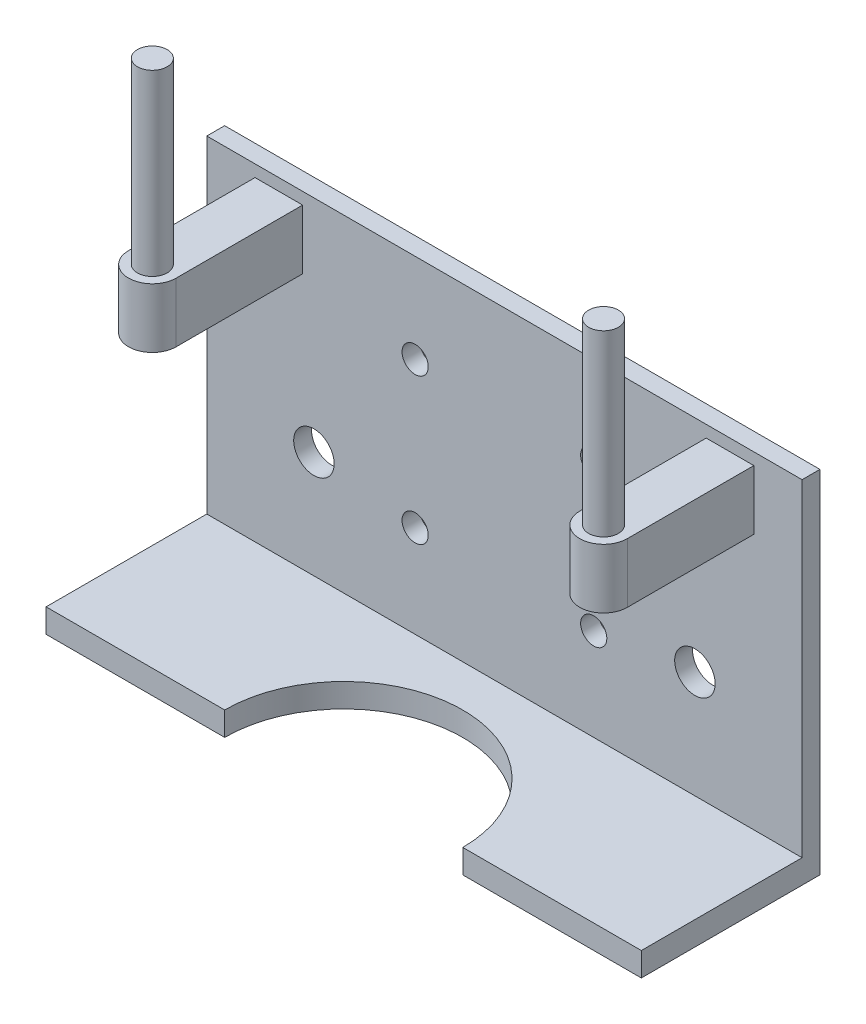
ISO-10303-21;
HEADER;
FILE_DESCRIPTION(('STEP AP214'),'2;1');
FILE_NAME('part.step','',(''),(''),'','','');
FILE_SCHEMA(('AUTOMOTIVE_DESIGN { 1 0 10303 214 1 1 1 1 }'));
ENDSEC;
DATA;
#1=APPLICATION_CONTEXT('core data for automotive mechanical design processes');
#2=APPLICATION_PROTOCOL_DEFINITION('international standard','automotive_design',2000,#1);
#3=PRODUCT_CONTEXT('',#1,'mechanical');
#4=PRODUCT('Part','Part','',(#3));
#5=PRODUCT_RELATED_PRODUCT_CATEGORY('part','',(#4));
#6=PRODUCT_DEFINITION_FORMATION('','',#4);
#7=PRODUCT_DEFINITION_CONTEXT('part definition',#1,'design');
#8=PRODUCT_DEFINITION('design','',#6,#7);
#9=PRODUCT_DEFINITION_SHAPE('','',#8);
#10=(LENGTH_UNIT() NAMED_UNIT(*) SI_UNIT(.MILLI.,.METRE.));
#11=(NAMED_UNIT(*) PLANE_ANGLE_UNIT() SI_UNIT($,.RADIAN.));
#12=(NAMED_UNIT(*) SI_UNIT($,.STERADIAN.) SOLID_ANGLE_UNIT());
#13=UNCERTAINTY_MEASURE_WITH_UNIT(LENGTH_MEASURE(1.E-05),#10,'distance_accuracy_value','');
#14=(GEOMETRIC_REPRESENTATION_CONTEXT(3) GLOBAL_UNCERTAINTY_ASSIGNED_CONTEXT((#13)) GLOBAL_UNIT_ASSIGNED_CONTEXT((#10,
#11,#12)) REPRESENTATION_CONTEXT('',''));
#15=CARTESIAN_POINT('',(0.,0.,0.));
#16=DIRECTION('',(0.,0.,1.));
#17=DIRECTION('',(1.,0.,0.));
#18=AXIS2_PLACEMENT_3D('',#15,#16,#17);
#19=CARTESIAN_POINT('',(-50.,-31.5,30.));
#20=DIRECTION('',(0.,0.,-1.));
#21=DIRECTION('',(-1.,0.,0.));
#22=AXIS2_PLACEMENT_3D('',#19,#20,#21);
#23=PLANE('',#22);
#24=DIRECTION('',(-1.,0.,0.));
#25=VECTOR('',#24,1.);
#26=CARTESIAN_POINT('',(-50.,-27.5,30.));
#27=LINE('',#26,#25);
#28=CARTESIAN_POINT('',(50.,-27.5,30.));
#29=VERTEX_POINT('',#28);
#30=CARTESIAN_POINT('',(20.,-27.5,30.));
#31=VERTEX_POINT('',#30);
#32=EDGE_CURVE('E165',#29,#31,#27,.T.);
#33=ORIENTED_EDGE('',*,*,#32,.T.);
#34=DIRECTION('',(0.,-1.,0.));
#35=VECTOR('',#34,1.);
#36=CARTESIAN_POINT('',(20.,-21.5,30.));
#37=LINE('',#36,#35);
#38=CARTESIAN_POINT('',(20.,-31.5,30.));
#39=VERTEX_POINT('',#38);
#40=EDGE_CURVE('E154',#31,#39,#37,.T.);
#41=ORIENTED_EDGE('',*,*,#40,.T.);
#42=DIRECTION('',(-1.,0.,0.));
#43=VECTOR('',#42,1.);
#44=CARTESIAN_POINT('',(-50.,-31.5,30.));
#45=LINE('',#44,#43);
#46=CARTESIAN_POINT('',(50.,-31.5,30.));
#47=VERTEX_POINT('',#46);
#48=EDGE_CURVE('E163',#47,#39,#45,.T.);
#49=ORIENTED_EDGE('',*,*,#48,.F.);
#50=DIRECTION('',(0.,1.,0.));
#51=VECTOR('',#50,1.);
#52=CARTESIAN_POINT('',(50.,-31.5,30.));
#53=LINE('',#52,#51);
#54=EDGE_CURVE('E178',#47,#29,#53,.T.);
#55=ORIENTED_EDGE('',*,*,#54,.T.);
#56=EDGE_LOOP('',(#33,#41,#49,#55));
#57=FACE_BOUND('',#56,.T.);
#58=ADVANCED_FACE('F40',(#57),#23,.F.);
#59=CARTESIAN_POINT('',(0.,0.,3.));
#60=DIRECTION('',(0.,0.,-1.));
#61=DIRECTION('',(-1.,0.,0.));
#62=AXIS2_PLACEMENT_3D('',#59,#60,#61);
#63=PLANE('',#62);
#64=CARTESIAN_POINT('',(15.,-12.,3.));
#65=DIRECTION('',(0.,0.,-1.));
#66=DIRECTION('',(-1.,0.,0.));
#67=AXIS2_PLACEMENT_3D('',#64,#65,#66);
#68=CIRCLE('',#67,2.2);
#69=CARTESIAN_POINT('',(12.8,-12.,3.));
#70=VERTEX_POINT('',#69);
#71=EDGE_CURVE('E229',#70,#70,#68,.T.);
#72=ORIENTED_EDGE('',*,*,#71,.T.);
#73=EDGE_LOOP('',(#72));
#74=FACE_BOUND('',#73,.T.);
#75=CARTESIAN_POINT('',(15.,12.5,3.));
#76=DIRECTION('',(0.,0.,-1.));
#77=DIRECTION('',(-1.,0.,0.));
#78=AXIS2_PLACEMENT_3D('',#75,#76,#77);
#79=CIRCLE('',#78,2.2);
#80=CARTESIAN_POINT('',(12.8,12.5,3.));
#81=VERTEX_POINT('',#80);
#82=EDGE_CURVE('E235',#81,#81,#79,.T.);
#83=ORIENTED_EDGE('',*,*,#82,.T.);
#84=EDGE_LOOP('',(#83));
#85=FACE_BOUND('',#84,.T.);
#86=CARTESIAN_POINT('',(-15.,-12.,3.));
#87=DIRECTION('',(0.,0.,1.));
#88=DIRECTION('',(1.,0.,0.));
#89=AXIS2_PLACEMENT_3D('',#86,#87,#88);
#90=CIRCLE('',#89,2.2);
#91=CARTESIAN_POINT('',(-12.8,-12.,3.));
#92=VERTEX_POINT('',#91);
#93=EDGE_CURVE('E225',#92,#92,#90,.T.);
#94=ORIENTED_EDGE('',*,*,#93,.F.);
#95=EDGE_LOOP('',(#94));
#96=FACE_BOUND('',#95,.T.);
#97=CARTESIAN_POINT('',(-15.,12.5,3.));
#98=DIRECTION('',(0.,0.,1.));
#99=DIRECTION('',(1.,0.,0.));
#100=AXIS2_PLACEMENT_3D('',#97,#98,#99);
#101=CIRCLE('',#100,2.2);
#102=CARTESIAN_POINT('',(-12.8,12.5,3.));
#103=VERTEX_POINT('',#102);
#104=EDGE_CURVE('E233',#103,#103,#101,.T.);
#105=ORIENTED_EDGE('',*,*,#104,.F.);
#106=EDGE_LOOP('',(#105));
#107=FACE_BOUND('',#106,.T.);
#108=CARTESIAN_POINT('',(-32.,-9.50000000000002,3.));
#109=DIRECTION('',(0.,0.,1.));
#110=DIRECTION('',(1.,0.,0.));
#111=AXIS2_PLACEMENT_3D('',#108,#109,#110);
#112=CIRCLE('',#111,3.39999999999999);
#113=CARTESIAN_POINT('',(-28.6,-9.50000000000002,3.));
#114=VERTEX_POINT('',#113);
#115=EDGE_CURVE('E166',#114,#114,#112,.T.);
#116=ORIENTED_EDGE('',*,*,#115,.F.);
#117=EDGE_LOOP('',(#116));
#118=FACE_BOUND('',#117,.T.);
#119=CARTESIAN_POINT('',(32.,-9.50000000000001,3.));
#120=DIRECTION('',(0.,0.,1.));
#121=DIRECTION('',(1.,0.,0.));
#122=AXIS2_PLACEMENT_3D('',#119,#120,#121);
#123=CIRCLE('',#122,3.39999999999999);
#124=CARTESIAN_POINT('',(35.4,-9.50000000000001,3.));
#125=VERTEX_POINT('',#124);
#126=EDGE_CURVE('E219',#125,#125,#123,.T.);
#127=ORIENTED_EDGE('',*,*,#126,.F.);
#128=EDGE_LOOP('',(#127));
#129=FACE_BOUND('',#128,.T.);
#130=DIRECTION('',(1.,0.,0.));
#131=VECTOR('',#130,1.);
#132=CARTESIAN_POINT('',(0.,15.5,3.));
#133=LINE('',#132,#131);
#134=CARTESIAN_POINT('',(33.9,15.5,3.));
#135=VERTEX_POINT('',#134);
#136=CARTESIAN_POINT('',(41.9,15.5,3.));
#137=VERTEX_POINT('',#136);
#138=EDGE_CURVE('E304',#135,#137,#133,.T.);
#139=ORIENTED_EDGE('',*,*,#138,.F.);
#140=DIRECTION('',(0.,1.,0.));
#141=VECTOR('',#140,1.);
#142=CARTESIAN_POINT('',(33.9,15.5,3.));
#143=LINE('',#142,#141);
#144=CARTESIAN_POINT('',(33.9,25.5,3.));
#145=VERTEX_POINT('',#144);
#146=EDGE_CURVE('E187',#135,#145,#143,.T.);
#147=ORIENTED_EDGE('',*,*,#146,.T.);
#148=DIRECTION('',(1.,0.,0.));
#149=VECTOR('',#148,1.);
#150=CARTESIAN_POINT('',(0.,25.5,3.));
#151=LINE('',#150,#149);
#152=CARTESIAN_POINT('',(41.9,25.5,3.));
#153=VERTEX_POINT('',#152);
#154=EDGE_CURVE('E299',#145,#153,#151,.T.);
#155=ORIENTED_EDGE('',*,*,#154,.T.);
#156=DIRECTION('',(0.,1.,0.));
#157=VECTOR('',#156,1.);
#158=CARTESIAN_POINT('',(41.9,15.5,3.));
#159=LINE('',#158,#157);
#160=EDGE_CURVE('E319',#137,#153,#159,.T.);
#161=ORIENTED_EDGE('',*,*,#160,.F.);
#162=EDGE_LOOP('',(#139,#147,#155,#161));
#163=FACE_BOUND('',#162,.T.);
#164=DIRECTION('',(0.,-1.,0.));
#165=VECTOR('',#164,1.);
#166=CARTESIAN_POINT('',(-50.,27.5,3.));
#167=LINE('',#166,#165);
#168=CARTESIAN_POINT('',(-50.,27.5,3.));
#169=VERTEX_POINT('',#168);
#170=CARTESIAN_POINT('',(-50.,-27.5,3.));
#171=VERTEX_POINT('',#170);
#172=EDGE_CURVE('E194',#169,#171,#167,.T.);
#173=ORIENTED_EDGE('',*,*,#172,.T.);
#174=DIRECTION('',(1.,0.,0.));
#175=VECTOR('',#174,1.);
#176=CARTESIAN_POINT('',(50.,-27.5,3.));
#177=LINE('',#176,#175);
#178=CARTESIAN_POINT('',(50.,-27.5,3.));
#179=VERTEX_POINT('',#178);
#180=EDGE_CURVE('E197',#171,#179,#177,.T.);
#181=ORIENTED_EDGE('',*,*,#180,.T.);
#182=DIRECTION('',(0.,1.,0.));
#183=VECTOR('',#182,1.);
#184=CARTESIAN_POINT('',(50.,27.5,3.));
#185=LINE('',#184,#183);
#186=CARTESIAN_POINT('',(50.,27.5,3.));
#187=VERTEX_POINT('',#186);
#188=EDGE_CURVE('E201',#179,#187,#185,.T.);
#189=ORIENTED_EDGE('',*,*,#188,.T.);
#190=DIRECTION('',(-1.,0.,0.));
#191=VECTOR('',#190,1.);
#192=CARTESIAN_POINT('',(50.,27.5,3.));
#193=LINE('',#192,#191);
#194=EDGE_CURVE('E203',#187,#169,#193,.T.);
#195=ORIENTED_EDGE('',*,*,#194,.T.);
#196=EDGE_LOOP('',(#173,#181,#189,#195));
#197=FACE_BOUND('',#196,.T.);
#198=DIRECTION('',(-1.,0.,0.));
#199=VECTOR('',#198,1.);
#200=CARTESIAN_POINT('',(0.,15.5,3.));
#201=LINE('',#200,#199);
#202=CARTESIAN_POINT('',(-33.9,15.5,3.));
#203=VERTEX_POINT('',#202);
#204=CARTESIAN_POINT('',(-41.9,15.5,3.));
#205=VERTEX_POINT('',#204);
#206=EDGE_CURVE('E261',#203,#205,#201,.T.);
#207=ORIENTED_EDGE('',*,*,#206,.T.);
#208=DIRECTION('',(0.,1.,0.));
#209=VECTOR('',#208,1.);
#210=CARTESIAN_POINT('',(-41.9,15.5,3.));
#211=LINE('',#210,#209);
#212=CARTESIAN_POINT('',(-41.9,25.5,3.));
#213=VERTEX_POINT('',#212);
#214=EDGE_CURVE('E285',#205,#213,#211,.T.);
#215=ORIENTED_EDGE('',*,*,#214,.T.);
#216=DIRECTION('',(-1.,0.,0.));
#217=VECTOR('',#216,1.);
#218=CARTESIAN_POINT('',(0.,25.5,3.));
#219=LINE('',#218,#217);
#220=CARTESIAN_POINT('',(-33.9,25.5,3.));
#221=VERTEX_POINT('',#220);
#222=EDGE_CURVE('E272',#221,#213,#219,.T.);
#223=ORIENTED_EDGE('',*,*,#222,.F.);
#224=DIRECTION('',(0.,1.,0.));
#225=VECTOR('',#224,1.);
#226=CARTESIAN_POINT('',(-33.9,15.5,3.));
#227=LINE('',#226,#225);
#228=EDGE_CURVE('E270',#203,#221,#227,.T.);
#229=ORIENTED_EDGE('',*,*,#228,.F.);
#230=EDGE_LOOP('',(#207,#215,#223,#229));
#231=FACE_BOUND('',#230,.T.);
#232=ADVANCED_FACE('F351',(#74,#85,#96,#107,#118,#129,#163,#197,#231),#63,.F.);
#233=CARTESIAN_POINT('',(-50.,27.5,3.));
#234=DIRECTION('',(1.,0.,0.));
#235=DIRECTION('',(0.,0.,-1.));
#236=AXIS2_PLACEMENT_3D('',#233,#234,#235);
#237=PLANE('',#236);
#238=DIRECTION('',(0.,-1.,0.));
#239=VECTOR('',#238,1.);
#240=CARTESIAN_POINT('',(-50.,27.5,0.));
#241=LINE('',#240,#239);
#242=CARTESIAN_POINT('',(-50.,27.5,0.));
#243=VERTEX_POINT('',#242);
#244=CARTESIAN_POINT('',(-50.,-31.5,0.));
#245=VERTEX_POINT('',#244);
#246=EDGE_CURVE('E193',#243,#245,#241,.T.);
#247=ORIENTED_EDGE('',*,*,#246,.T.);
#248=DIRECTION('',(0.,0.,-1.));
#249=VECTOR('',#248,1.);
#250=CARTESIAN_POINT('',(-50.,-31.5,0.));
#251=LINE('',#250,#249);
#252=CARTESIAN_POINT('',(-50.,-31.5,30.));
#253=VERTEX_POINT('',#252);
#254=EDGE_CURVE('E190',#253,#245,#251,.T.);
#255=ORIENTED_EDGE('',*,*,#254,.F.);
#256=DIRECTION('',(0.,1.,0.));
#257=VECTOR('',#256,1.);
#258=CARTESIAN_POINT('',(-50.,-31.5,30.));
#259=LINE('',#258,#257);
#260=CARTESIAN_POINT('',(-50.,-27.5,30.));
#261=VERTEX_POINT('',#260);
#262=EDGE_CURVE('E174',#253,#261,#259,.T.);
#263=ORIENTED_EDGE('',*,*,#262,.T.);
#264=DIRECTION('',(0.,0.,-1.));
#265=VECTOR('',#264,1.);
#266=CARTESIAN_POINT('',(-50.,-27.5,0.));
#267=LINE('',#266,#265);
#268=EDGE_CURVE('E183',#261,#171,#267,.T.);
#269=ORIENTED_EDGE('',*,*,#268,.T.);
#270=ORIENTED_EDGE('',*,*,#172,.F.);
#271=DIRECTION('',(0.,0.,-1.));
#272=VECTOR('',#271,1.);
#273=CARTESIAN_POINT('',(-50.,27.5,3.));
#274=LINE('',#273,#272);
#275=EDGE_CURVE('E205',#169,#243,#274,.T.);
#276=ORIENTED_EDGE('',*,*,#275,.T.);
#277=EDGE_LOOP('',(#247,#255,#263,#269,#270,#276));
#278=FACE_BOUND('',#277,.T.);
#279=ADVANCED_FACE('F42',(#278),#237,.F.);
#280=CARTESIAN_POINT('',(50.,27.5,3.));
#281=DIRECTION('',(-1.,0.,0.));
#282=DIRECTION('',(0.,-1.,0.));
#283=AXIS2_PLACEMENT_3D('',#280,#281,#282);
#284=PLANE('',#283);
#285=DIRECTION('',(0.,1.,0.));
#286=VECTOR('',#285,1.);
#287=CARTESIAN_POINT('',(50.,27.5,0.));
#288=LINE('',#287,#286);
#289=CARTESIAN_POINT('',(50.,-31.5,0.));
#290=VERTEX_POINT('',#289);
#291=CARTESIAN_POINT('',(50.,27.5,0.));
#292=VERTEX_POINT('',#291);
#293=EDGE_CURVE('E207',#290,#292,#288,.T.);
#294=ORIENTED_EDGE('',*,*,#293,.T.);
#295=DIRECTION('',(0.,0.,-1.));
#296=VECTOR('',#295,1.);
#297=CARTESIAN_POINT('',(50.,27.5,3.));
#298=LINE('',#297,#296);
#299=EDGE_CURVE('E212',#187,#292,#298,.T.);
#300=ORIENTED_EDGE('',*,*,#299,.F.);
#301=ORIENTED_EDGE('',*,*,#188,.F.);
#302=DIRECTION('',(0.,0.,1.));
#303=VECTOR('',#302,1.);
#304=CARTESIAN_POINT('',(50.,-27.5,0.));
#305=LINE('',#304,#303);
#306=EDGE_CURVE('E186',#179,#29,#305,.T.);
#307=ORIENTED_EDGE('',*,*,#306,.T.);
#308=ORIENTED_EDGE('',*,*,#54,.F.);
#309=DIRECTION('',(0.,0.,1.));
#310=VECTOR('',#309,1.);
#311=CARTESIAN_POINT('',(50.,-31.5,0.));
#312=LINE('',#311,#310);
#313=EDGE_CURVE('E172',#290,#47,#312,.T.);
#314=ORIENTED_EDGE('',*,*,#313,.F.);
#315=EDGE_LOOP('',(#294,#300,#301,#307,#308,#314));
#316=FACE_BOUND('',#315,.T.);
#317=ADVANCED_FACE('F332',(#316),#284,.F.);
#318=CARTESIAN_POINT('',(50.,27.5,3.));
#319=DIRECTION('',(0.,-1.,0.));
#320=DIRECTION('',(1.,0.,0.));
#321=AXIS2_PLACEMENT_3D('',#318,#319,#320);
#322=PLANE('',#321);
#323=DIRECTION('',(-1.,0.,0.));
#324=VECTOR('',#323,1.);
#325=CARTESIAN_POINT('',(50.,27.5,0.));
#326=LINE('',#325,#324);
#327=EDGE_CURVE('E198',#292,#243,#326,.T.);
#328=ORIENTED_EDGE('',*,*,#327,.T.);
#329=ORIENTED_EDGE('',*,*,#275,.F.);
#330=ORIENTED_EDGE('',*,*,#194,.F.);
#331=ORIENTED_EDGE('',*,*,#299,.T.);
#332=EDGE_LOOP('',(#328,#329,#330,#331));
#333=FACE_BOUND('',#332,.T.);
#334=ADVANCED_FACE('F348',(#333),#322,.F.);
#335=CARTESIAN_POINT('',(0.,0.,0.));
#336=DIRECTION('',(0.,0.,-1.));
#337=DIRECTION('',(-1.,0.,0.));
#338=AXIS2_PLACEMENT_3D('',#335,#336,#337);
#339=PLANE('',#338);
#340=CARTESIAN_POINT('',(15.,-12.,0.));
#341=DIRECTION('',(0.,0.,-1.));
#342=DIRECTION('',(-1.,0.,0.));
#343=AXIS2_PLACEMENT_3D('',#340,#341,#342);
#344=CIRCLE('',#343,2.2);
#345=CARTESIAN_POINT('',(12.8,-12.,0.));
#346=VERTEX_POINT('',#345);
#347=EDGE_CURVE('E44',#346,#346,#344,.F.);
#348=ORIENTED_EDGE('',*,*,#347,.T.);
#349=EDGE_LOOP('',(#348));
#350=FACE_BOUND('',#349,.T.);
#351=CARTESIAN_POINT('',(15.,12.5,0.));
#352=DIRECTION('',(0.,0.,-1.));
#353=DIRECTION('',(-1.,0.,0.));
#354=AXIS2_PLACEMENT_3D('',#351,#352,#353);
#355=CIRCLE('',#354,2.2);
#356=CARTESIAN_POINT('',(12.8,12.5,0.));
#357=VERTEX_POINT('',#356);
#358=EDGE_CURVE('E227',#357,#357,#355,.F.);
#359=ORIENTED_EDGE('',*,*,#358,.T.);
#360=EDGE_LOOP('',(#359));
#361=FACE_BOUND('',#360,.T.);
#362=CARTESIAN_POINT('',(-15.,-12.,0.));
#363=DIRECTION('',(0.,0.,-1.));
#364=DIRECTION('',(-1.,0.,0.));
#365=AXIS2_PLACEMENT_3D('',#362,#363,#364);
#366=CIRCLE('',#365,2.2);
#367=CARTESIAN_POINT('',(-17.2,-12.,0.));
#368=VERTEX_POINT('',#367);
#369=EDGE_CURVE('E224',#368,#368,#366,.T.);
#370=ORIENTED_EDGE('',*,*,#369,.F.);
#371=EDGE_LOOP('',(#370));
#372=FACE_BOUND('',#371,.T.);
#373=CARTESIAN_POINT('',(-15.,12.5,0.));
#374=DIRECTION('',(0.,0.,-1.));
#375=DIRECTION('',(-1.,0.,0.));
#376=AXIS2_PLACEMENT_3D('',#373,#374,#375);
#377=CIRCLE('',#376,2.2);
#378=CARTESIAN_POINT('',(-17.2,12.5,0.));
#379=VERTEX_POINT('',#378);
#380=EDGE_CURVE('E221',#379,#379,#377,.T.);
#381=ORIENTED_EDGE('',*,*,#380,.F.);
#382=EDGE_LOOP('',(#381));
#383=FACE_BOUND('',#382,.T.);
#384=CARTESIAN_POINT('',(-32.,-9.50000000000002,0.));
#385=DIRECTION('',(0.,0.,-1.));
#386=DIRECTION('',(-1.,0.,0.));
#387=AXIS2_PLACEMENT_3D('',#384,#385,#386);
#388=CIRCLE('',#387,3.39999999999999);
#389=CARTESIAN_POINT('',(-35.4,-9.50000000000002,0.));
#390=VERTEX_POINT('',#389);
#391=EDGE_CURVE('E217',#390,#390,#388,.T.);
#392=ORIENTED_EDGE('',*,*,#391,.F.);
#393=EDGE_LOOP('',(#392));
#394=FACE_BOUND('',#393,.T.);
#395=CARTESIAN_POINT('',(32.,-9.50000000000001,0.));
#396=DIRECTION('',(0.,0.,-1.));
#397=DIRECTION('',(-1.,0.,0.));
#398=AXIS2_PLACEMENT_3D('',#395,#396,#397);
#399=CIRCLE('',#398,3.39999999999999);
#400=CARTESIAN_POINT('',(28.6,-9.50000000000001,0.));
#401=VERTEX_POINT('',#400);
#402=EDGE_CURVE('E252',#401,#401,#399,.T.);
#403=ORIENTED_EDGE('',*,*,#402,.F.);
#404=EDGE_LOOP('',(#403));
#405=FACE_BOUND('',#404,.T.);
#406=ORIENTED_EDGE('',*,*,#246,.F.);
#407=ORIENTED_EDGE('',*,*,#327,.F.);
#408=ORIENTED_EDGE('',*,*,#293,.F.);
#409=DIRECTION('',(1.,0.,0.));
#410=VECTOR('',#409,1.);
#411=CARTESIAN_POINT('',(-50.,-31.5,0.));
#412=LINE('',#411,#410);
#413=EDGE_CURVE('E326',#245,#290,#412,.T.);
#414=ORIENTED_EDGE('',*,*,#413,.F.);
#415=EDGE_LOOP('',(#406,#407,#408,#414));
#416=FACE_BOUND('',#415,.T.);
#417=ADVANCED_FACE('F346',(#350,#361,#372,#383,#394,#405,#416),#339,.T.);
#418=CARTESIAN_POINT('',(0.,-27.5,0.));
#419=DIRECTION('',(0.,1.,0.));
#420=DIRECTION('',(-1.,0.,0.));
#421=AXIS2_PLACEMENT_3D('',#418,#419,#420);
#422=PLANE('',#421);
#423=CARTESIAN_POINT('',(0.,-27.5,30.));
#424=DIRECTION('',(0.,1.,0.));
#425=DIRECTION('',(-1.,0.,0.));
#426=AXIS2_PLACEMENT_3D('',#423,#424,#425);
#427=CIRCLE('',#426,20.);
#428=CARTESIAN_POINT('',(-20.,-27.5,30.));
#429=VERTEX_POINT('',#428);
#430=EDGE_CURVE('E167',#31,#429,#427,.T.);
#431=ORIENTED_EDGE('',*,*,#430,.F.);
#432=ORIENTED_EDGE('',*,*,#32,.F.);
#433=ORIENTED_EDGE('',*,*,#306,.F.);
#434=ORIENTED_EDGE('',*,*,#180,.F.);
#435=ORIENTED_EDGE('',*,*,#268,.F.);
#436=EDGE_CURVE('E189',#429,#261,#27,.T.);
#437=ORIENTED_EDGE('',*,*,#436,.F.);
#438=EDGE_LOOP('',(#431,#432,#433,#434,#435,#437));
#439=FACE_BOUND('',#438,.T.);
#440=ADVANCED_FACE('F336',(#439),#422,.T.);
#441=CARTESIAN_POINT('',(-20.,-31.5,30.));
#442=VERTEX_POINT('',#441);
#443=EDGE_CURVE('E175',#442,#253,#45,.T.);
#444=ORIENTED_EDGE('',*,*,#443,.F.);
#445=DIRECTION('',(0.,-1.,0.));
#446=VECTOR('',#445,1.);
#447=CARTESIAN_POINT('',(-20.,-21.5,30.));
#448=LINE('',#447,#446);
#449=EDGE_CURVE('E57',#442,#429,#448,.F.);
#450=ORIENTED_EDGE('',*,*,#449,.T.);
#451=ORIENTED_EDGE('',*,*,#436,.T.);
#452=ORIENTED_EDGE('',*,*,#262,.F.);
#453=EDGE_LOOP('',(#444,#450,#451,#452));
#454=FACE_BOUND('',#453,.T.);
#455=ADVANCED_FACE('F340',(#454),#23,.F.);
#456=CARTESIAN_POINT('',(0.,-31.5,0.));
#457=DIRECTION('',(0.,1.,0.));
#458=DIRECTION('',(-1.,0.,0.));
#459=AXIS2_PLACEMENT_3D('',#456,#457,#458);
#460=PLANE('',#459);
#461=ORIENTED_EDGE('',*,*,#48,.T.);
#462=CARTESIAN_POINT('',(0.,-31.5,30.));
#463=DIRECTION('',(0.,1.,0.));
#464=DIRECTION('',(-1.,0.,0.));
#465=AXIS2_PLACEMENT_3D('',#462,#463,#464);
#466=CIRCLE('',#465,20.);
#467=EDGE_CURVE('E11',#39,#442,#466,.T.);
#468=ORIENTED_EDGE('',*,*,#467,.T.);
#469=ORIENTED_EDGE('',*,*,#443,.T.);
#470=ORIENTED_EDGE('',*,*,#254,.T.);
#471=ORIENTED_EDGE('',*,*,#413,.T.);
#472=ORIENTED_EDGE('',*,*,#313,.T.);
#473=EDGE_LOOP('',(#461,#468,#469,#470,#471,#472));
#474=FACE_BOUND('',#473,.T.);
#475=ADVANCED_FACE('F169',(#474),#460,.F.);
#476=CARTESIAN_POINT('',(33.9,15.5,0.));
#477=DIRECTION('',(-1.,0.,0.));
#478=DIRECTION('',(0.,-1.,0.));
#479=AXIS2_PLACEMENT_3D('',#476,#477,#478);
#480=PLANE('',#479);
#481=DIRECTION('',(0.,0.,1.));
#482=VECTOR('',#481,1.);
#483=CARTESIAN_POINT('',(33.9,25.5,0.));
#484=LINE('',#483,#482);
#485=CARTESIAN_POINT('',(33.9,25.5,24.25));
#486=VERTEX_POINT('',#485);
#487=EDGE_CURVE('E292',#145,#486,#484,.T.);
#488=ORIENTED_EDGE('',*,*,#487,.F.);
#489=ORIENTED_EDGE('',*,*,#146,.F.);
#490=DIRECTION('',(0.,0.,1.));
#491=VECTOR('',#490,1.);
#492=CARTESIAN_POINT('',(33.9,15.5,0.));
#493=LINE('',#492,#491);
#494=CARTESIAN_POINT('',(33.9,15.5,24.25));
#495=VERTEX_POINT('',#494);
#496=EDGE_CURVE('E295',#135,#495,#493,.T.);
#497=ORIENTED_EDGE('',*,*,#496,.T.);
#498=DIRECTION('',(0.,1.,0.));
#499=VECTOR('',#498,1.);
#500=CARTESIAN_POINT('',(33.9,15.5,24.25));
#501=LINE('',#500,#499);
#502=EDGE_CURVE('E306',#495,#486,#501,.T.);
#503=ORIENTED_EDGE('',*,*,#502,.T.);
#504=EDGE_LOOP('',(#488,#489,#497,#503));
#505=FACE_BOUND('',#504,.T.);
#506=ADVANCED_FACE('F390',(#505),#480,.T.);
#507=CARTESIAN_POINT('',(41.9,15.5,0.));
#508=DIRECTION('',(-1.,0.,0.));
#509=DIRECTION('',(0.,0.,1.));
#510=AXIS2_PLACEMENT_3D('',#507,#508,#509);
#511=PLANE('',#510);
#512=DIRECTION('',(0.,0.,1.));
#513=VECTOR('',#512,1.);
#514=CARTESIAN_POINT('',(41.9,25.5,0.));
#515=LINE('',#514,#513);
#516=CARTESIAN_POINT('',(41.9,25.5,24.25));
#517=VERTEX_POINT('',#516);
#518=EDGE_CURVE('E312',#153,#517,#515,.T.);
#519=ORIENTED_EDGE('',*,*,#518,.T.);
#520=DIRECTION('',(0.,1.,0.));
#521=VECTOR('',#520,1.);
#522=CARTESIAN_POINT('',(41.9,15.5,24.25));
#523=LINE('',#522,#521);
#524=CARTESIAN_POINT('',(41.9,15.5,24.25));
#525=VERTEX_POINT('',#524);
#526=EDGE_CURVE('E322',#525,#517,#523,.T.);
#527=ORIENTED_EDGE('',*,*,#526,.F.);
#528=DIRECTION('',(0.,0.,1.));
#529=VECTOR('',#528,1.);
#530=CARTESIAN_POINT('',(41.9,15.5,0.));
#531=LINE('',#530,#529);
#532=EDGE_CURVE('E302',#137,#525,#531,.T.);
#533=ORIENTED_EDGE('',*,*,#532,.F.);
#534=ORIENTED_EDGE('',*,*,#160,.T.);
#535=EDGE_LOOP('',(#519,#527,#533,#534));
#536=FACE_BOUND('',#535,.T.);
#537=ADVANCED_FACE('F400',(#536),#511,.F.);
#538=CARTESIAN_POINT('',(37.9,15.5,24.25));
#539=DIRECTION('',(0.,1.,0.));
#540=DIRECTION('',(-1.,0.,0.));
#541=AXIS2_PLACEMENT_3D('',#538,#539,#540);
#542=CYLINDRICAL_SURFACE('',#541,3.99999999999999);
#543=CARTESIAN_POINT('',(37.9,25.5,24.25));
#544=DIRECTION('',(0.,1.,0.));
#545=DIRECTION('',(-1.,0.,0.));
#546=AXIS2_PLACEMENT_3D('',#543,#544,#545);
#547=CIRCLE('',#546,3.99999999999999);
#548=EDGE_CURVE('E309',#486,#517,#547,.T.);
#549=ORIENTED_EDGE('',*,*,#548,.F.);
#550=ORIENTED_EDGE('',*,*,#502,.F.);
#551=CARTESIAN_POINT('',(37.9,15.5,24.25));
#552=DIRECTION('',(0.,1.,0.));
#553=DIRECTION('',(-1.,0.,0.));
#554=AXIS2_PLACEMENT_3D('',#551,#552,#553);
#555=CIRCLE('',#554,3.99999999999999);
#556=EDGE_CURVE('E298',#495,#525,#555,.T.);
#557=ORIENTED_EDGE('',*,*,#556,.T.);
#558=ORIENTED_EDGE('',*,*,#526,.T.);
#559=EDGE_LOOP('',(#549,#550,#557,#558));
#560=FACE_BOUND('',#559,.T.);
#561=ADVANCED_FACE('F402',(#560),#542,.T.);
#562=CARTESIAN_POINT('',(0.,15.5,0.));
#563=DIRECTION('',(0.,1.,0.));
#564=DIRECTION('',(-1.,0.,0.));
#565=AXIS2_PLACEMENT_3D('',#562,#563,#564);
#566=PLANE('',#565);
#567=ORIENTED_EDGE('',*,*,#496,.F.);
#568=ORIENTED_EDGE('',*,*,#138,.T.);
#569=ORIENTED_EDGE('',*,*,#532,.T.);
#570=ORIENTED_EDGE('',*,*,#556,.F.);
#571=EDGE_LOOP('',(#567,#568,#569,#570));
#572=FACE_BOUND('',#571,.T.);
#573=ADVANCED_FACE('F405',(#572),#566,.F.);
#574=CARTESIAN_POINT('',(0.,25.5,0.));
#575=DIRECTION('',(0.,1.,0.));
#576=DIRECTION('',(-1.,0.,0.));
#577=AXIS2_PLACEMENT_3D('',#574,#575,#576);
#578=PLANE('',#577);
#579=CARTESIAN_POINT('',(37.9,25.5,24.25));
#580=DIRECTION('',(0.,1.,0.));
#581=DIRECTION('',(-1.,0.,0.));
#582=AXIS2_PLACEMENT_3D('',#579,#580,#581);
#583=CIRCLE('',#582,2.5);
#584=CARTESIAN_POINT('',(35.4,25.5,24.25));
#585=VERTEX_POINT('',#584);
#586=EDGE_CURVE('E282',#585,#585,#583,.T.);
#587=ORIENTED_EDGE('',*,*,#586,.F.);
#588=EDGE_LOOP('',(#587));
#589=FACE_BOUND('',#588,.T.);
#590=ORIENTED_EDGE('',*,*,#487,.T.);
#591=ORIENTED_EDGE('',*,*,#548,.T.);
#592=ORIENTED_EDGE('',*,*,#518,.F.);
#593=ORIENTED_EDGE('',*,*,#154,.F.);
#594=EDGE_LOOP('',(#590,#591,#592,#593));
#595=FACE_BOUND('',#594,.T.);
#596=ADVANCED_FACE('F410',(#589,#595),#578,.T.);
#597=CARTESIAN_POINT('',(37.9,55.5,24.25));
#598=DIRECTION('',(0.,-1.,0.));
#599=DIRECTION('',(1.,0.,0.));
#600=AXIS2_PLACEMENT_3D('',#597,#598,#599);
#601=CYLINDRICAL_SURFACE('',#600,2.5);
#602=CARTESIAN_POINT('',(37.9,55.5,24.25));
#603=DIRECTION('',(0.,1.,0.));
#604=DIRECTION('',(-1.,0.,0.));
#605=AXIS2_PLACEMENT_3D('',#602,#603,#604);
#606=CIRCLE('',#605,2.5);
#607=CARTESIAN_POINT('',(35.4,55.5,24.25));
#608=VERTEX_POINT('',#607);
#609=EDGE_CURVE('E289',#608,#608,#606,.T.);
#610=ORIENTED_EDGE('',*,*,#609,.F.);
#611=EDGE_LOOP('',(#610));
#612=FACE_BOUND('',#611,.T.);
#613=ORIENTED_EDGE('',*,*,#586,.T.);
#614=EDGE_LOOP('',(#613));
#615=FACE_BOUND('',#614,.T.);
#616=ADVANCED_FACE('F413',(#612,#615),#601,.T.);
#617=CARTESIAN_POINT('',(37.9,55.5,24.25));
#618=DIRECTION('',(0.,1.,0.));
#619=DIRECTION('',(-1.,0.,0.));
#620=AXIS2_PLACEMENT_3D('',#617,#618,#619);
#621=PLANE('',#620);
#622=ORIENTED_EDGE('',*,*,#609,.T.);
#623=EDGE_LOOP('',(#622));
#624=FACE_BOUND('',#623,.T.);
#625=ADVANCED_FACE('F420',(#624),#621,.T.);
#626=CARTESIAN_POINT('',(-33.9,15.5,0.));
#627=DIRECTION('',(-1.,0.,0.));
#628=DIRECTION('',(0.,-1.,0.));
#629=AXIS2_PLACEMENT_3D('',#626,#627,#628);
#630=PLANE('',#629);
#631=DIRECTION('',(0.,0.,1.));
#632=VECTOR('',#631,1.);
#633=CARTESIAN_POINT('',(-33.9,25.5,0.));
#634=LINE('',#633,#632);
#635=CARTESIAN_POINT('',(-33.9,25.5,24.25));
#636=VERTEX_POINT('',#635);
#637=EDGE_CURVE('E64',#221,#636,#634,.T.);
#638=ORIENTED_EDGE('',*,*,#637,.T.);
#639=DIRECTION('',(0.,1.,0.));
#640=VECTOR('',#639,1.);
#641=CARTESIAN_POINT('',(-33.9,15.5,24.25));
#642=LINE('',#641,#640);
#643=CARTESIAN_POINT('',(-33.9,15.5,24.25));
#644=VERTEX_POINT('',#643);
#645=EDGE_CURVE('E279',#644,#636,#642,.T.);
#646=ORIENTED_EDGE('',*,*,#645,.F.);
#647=DIRECTION('',(0.,0.,1.));
#648=VECTOR('',#647,1.);
#649=CARTESIAN_POINT('',(-33.9,15.5,0.));
#650=LINE('',#649,#648);
#651=EDGE_CURVE('E258',#203,#644,#650,.T.);
#652=ORIENTED_EDGE('',*,*,#651,.F.);
#653=ORIENTED_EDGE('',*,*,#228,.T.);
#654=EDGE_LOOP('',(#638,#646,#652,#653));
#655=FACE_BOUND('',#654,.T.);
#656=ADVANCED_FACE('F424',(#655),#630,.F.);
#657=CARTESIAN_POINT('',(-37.9,15.5,24.25));
#658=DIRECTION('',(0.,1.,0.));
#659=DIRECTION('',(-1.,0.,0.));
#660=AXIS2_PLACEMENT_3D('',#657,#658,#659);
#661=CYLINDRICAL_SURFACE('',#660,3.99999999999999);
#662=CARTESIAN_POINT('',(-37.9,25.5,24.25));
#663=DIRECTION('',(0.,-1.,0.));
#664=DIRECTION('',(1.,0.,0.));
#665=AXIS2_PLACEMENT_3D('',#662,#663,#664);
#666=CIRCLE('',#665,3.99999999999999);
#667=CARTESIAN_POINT('',(-41.9,25.5,24.25));
#668=VERTEX_POINT('',#667);
#669=EDGE_CURVE('E262',#636,#668,#666,.T.);
#670=ORIENTED_EDGE('',*,*,#669,.T.);
#671=DIRECTION('',(0.,1.,0.));
#672=VECTOR('',#671,1.);
#673=CARTESIAN_POINT('',(-41.9,15.5,24.25));
#674=LINE('',#673,#672);
#675=CARTESIAN_POINT('',(-41.9,15.5,24.25));
#676=VERTEX_POINT('',#675);
#677=EDGE_CURVE('E283',#676,#668,#674,.T.);
#678=ORIENTED_EDGE('',*,*,#677,.F.);
#679=CARTESIAN_POINT('',(-37.9,15.5,24.25));
#680=DIRECTION('',(0.,-1.,0.));
#681=DIRECTION('',(1.,0.,0.));
#682=AXIS2_PLACEMENT_3D('',#679,#680,#681);
#683=CIRCLE('',#682,3.99999999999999);
#684=EDGE_CURVE('E268',#644,#676,#683,.T.);
#685=ORIENTED_EDGE('',*,*,#684,.F.);
#686=ORIENTED_EDGE('',*,*,#645,.T.);
#687=EDGE_LOOP('',(#670,#678,#685,#686));
#688=FACE_BOUND('',#687,.T.);
#689=ADVANCED_FACE('F428',(#688),#661,.T.);
#690=CARTESIAN_POINT('',(-41.9,15.5,0.));
#691=DIRECTION('',(-1.,0.,0.));
#692=DIRECTION('',(0.,0.,1.));
#693=AXIS2_PLACEMENT_3D('',#690,#691,#692);
#694=PLANE('',#693);
#695=DIRECTION('',(0.,0.,1.));
#696=VECTOR('',#695,1.);
#697=CARTESIAN_POINT('',(-41.9,25.5,0.));
#698=LINE('',#697,#696);
#699=EDGE_CURVE('E274',#213,#668,#698,.T.);
#700=ORIENTED_EDGE('',*,*,#699,.F.);
#701=ORIENTED_EDGE('',*,*,#214,.F.);
#702=DIRECTION('',(0.,0.,1.));
#703=VECTOR('',#702,1.);
#704=CARTESIAN_POINT('',(-41.9,15.5,0.));
#705=LINE('',#704,#703);
#706=EDGE_CURVE('E265',#205,#676,#705,.T.);
#707=ORIENTED_EDGE('',*,*,#706,.T.);
#708=ORIENTED_EDGE('',*,*,#677,.T.);
#709=EDGE_LOOP('',(#700,#701,#707,#708));
#710=FACE_BOUND('',#709,.T.);
#711=ADVANCED_FACE('F364',(#710),#694,.T.);
#712=CARTESIAN_POINT('',(0.,15.5,0.));
#713=DIRECTION('',(0.,1.,0.));
#714=DIRECTION('',(1.,0.,0.));
#715=AXIS2_PLACEMENT_3D('',#712,#713,#714);
#716=PLANE('',#715);
#717=ORIENTED_EDGE('',*,*,#651,.T.);
#718=ORIENTED_EDGE('',*,*,#684,.T.);
#719=ORIENTED_EDGE('',*,*,#706,.F.);
#720=ORIENTED_EDGE('',*,*,#206,.F.);
#721=EDGE_LOOP('',(#717,#718,#719,#720));
#722=FACE_BOUND('',#721,.T.);
#723=ADVANCED_FACE('F360',(#722),#716,.F.);
#724=CARTESIAN_POINT('',(0.,25.5,0.));
#725=DIRECTION('',(0.,1.,0.));
#726=DIRECTION('',(1.,0.,0.));
#727=AXIS2_PLACEMENT_3D('',#724,#725,#726);
#728=PLANE('',#727);
#729=CARTESIAN_POINT('',(-37.9,25.5,24.25));
#730=DIRECTION('',(0.,1.,0.));
#731=DIRECTION('',(-1.,0.,0.));
#732=AXIS2_PLACEMENT_3D('',#729,#730,#731);
#733=CIRCLE('',#732,2.5);
#734=CARTESIAN_POINT('',(-40.4,25.5,24.25));
#735=VERTEX_POINT('',#734);
#736=EDGE_CURVE('E49',#735,#735,#733,.T.);
#737=ORIENTED_EDGE('',*,*,#736,.F.);
#738=EDGE_LOOP('',(#737));
#739=FACE_BOUND('',#738,.T.);
#740=ORIENTED_EDGE('',*,*,#637,.F.);
#741=ORIENTED_EDGE('',*,*,#222,.T.);
#742=ORIENTED_EDGE('',*,*,#699,.T.);
#743=ORIENTED_EDGE('',*,*,#669,.F.);
#744=EDGE_LOOP('',(#740,#741,#742,#743));
#745=FACE_BOUND('',#744,.T.);
#746=ADVANCED_FACE('F365',(#739,#745),#728,.T.);
#747=CARTESIAN_POINT('',(-37.9,55.5,24.25));
#748=DIRECTION('',(0.,-1.,0.));
#749=DIRECTION('',(1.,0.,0.));
#750=AXIS2_PLACEMENT_3D('',#747,#748,#749);
#751=CYLINDRICAL_SURFACE('',#750,2.5);
#752=CARTESIAN_POINT('',(-37.9,55.5,24.25));
#753=DIRECTION('',(0.,-1.,0.));
#754=DIRECTION('',(1.,0.,0.));
#755=AXIS2_PLACEMENT_3D('',#752,#753,#754);
#756=CIRCLE('',#755,2.5);
#757=CARTESIAN_POINT('',(-35.4,55.5,24.25));
#758=VERTEX_POINT('',#757);
#759=EDGE_CURVE('E255',#758,#758,#756,.T.);
#760=ORIENTED_EDGE('',*,*,#759,.T.);
#761=EDGE_LOOP('',(#760));
#762=FACE_BOUND('',#761,.T.);
#763=ORIENTED_EDGE('',*,*,#736,.T.);
#764=EDGE_LOOP('',(#763));
#765=FACE_BOUND('',#764,.T.);
#766=ADVANCED_FACE('F367',(#762,#765),#751,.T.);
#767=CARTESIAN_POINT('',(-37.9,55.5,24.25));
#768=DIRECTION('',(0.,1.,0.));
#769=DIRECTION('',(1.,0.,0.));
#770=AXIS2_PLACEMENT_3D('',#767,#768,#769);
#771=PLANE('',#770);
#772=ORIENTED_EDGE('',*,*,#759,.F.);
#773=EDGE_LOOP('',(#772));
#774=FACE_BOUND('',#773,.T.);
#775=ADVANCED_FACE('F374',(#774),#771,.T.);
#776=CARTESIAN_POINT('',(32.,-9.50000000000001,3.));
#777=DIRECTION('',(0.,0.,1.));
#778=DIRECTION('',(1.,0.,0.));
#779=AXIS2_PLACEMENT_3D('',#776,#777,#778);
#780=CYLINDRICAL_SURFACE('',#779,3.39999999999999);
#781=ORIENTED_EDGE('',*,*,#402,.T.);
#782=EDGE_LOOP('',(#781));
#783=FACE_BOUND('',#782,.T.);
#784=ORIENTED_EDGE('',*,*,#126,.T.);
#785=EDGE_LOOP('',(#784));
#786=FACE_BOUND('',#785,.T.);
#787=ADVANCED_FACE('F466',(#783,#786),#780,.F.);
#788=CARTESIAN_POINT('',(-32.,-9.50000000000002,3.));
#789=DIRECTION('',(0.,0.,1.));
#790=DIRECTION('',(1.,0.,0.));
#791=AXIS2_PLACEMENT_3D('',#788,#789,#790);
#792=CYLINDRICAL_SURFACE('',#791,3.39999999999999);
#793=ORIENTED_EDGE('',*,*,#391,.T.);
#794=EDGE_LOOP('',(#793));
#795=FACE_BOUND('',#794,.T.);
#796=ORIENTED_EDGE('',*,*,#115,.T.);
#797=EDGE_LOOP('',(#796));
#798=FACE_BOUND('',#797,.T.);
#799=ADVANCED_FACE('F476',(#795,#798),#792,.F.);
#800=CARTESIAN_POINT('',(0.,-21.5,30.));
#801=DIRECTION('',(0.,-1.,0.));
#802=DIRECTION('',(1.,0.,0.));
#803=AXIS2_PLACEMENT_3D('',#800,#801,#802);
#804=CYLINDRICAL_SURFACE('',#803,20.);
#805=ORIENTED_EDGE('',*,*,#430,.T.);
#806=ORIENTED_EDGE('',*,*,#449,.F.);
#807=ORIENTED_EDGE('',*,*,#467,.F.);
#808=ORIENTED_EDGE('',*,*,#40,.F.);
#809=EDGE_LOOP('',(#805,#806,#807,#808));
#810=FACE_BOUND('',#809,.T.);
#811=ADVANCED_FACE('F153',(#810),#804,.F.);
#812=CARTESIAN_POINT('',(-15.,12.5,-7.));
#813=DIRECTION('',(0.,0.,1.));
#814=DIRECTION('',(1.,0.,0.));
#815=AXIS2_PLACEMENT_3D('',#812,#813,#814);
#816=CYLINDRICAL_SURFACE('',#815,2.2);
#817=ORIENTED_EDGE('',*,*,#380,.T.);
#818=EDGE_LOOP('',(#817));
#819=FACE_BOUND('',#818,.T.);
#820=ORIENTED_EDGE('',*,*,#104,.T.);
#821=EDGE_LOOP('',(#820));
#822=FACE_BOUND('',#821,.T.);
#823=ADVANCED_FACE('F490',(#819,#822),#816,.F.);
#824=CARTESIAN_POINT('',(-15.,-12.,-7.));
#825=DIRECTION('',(0.,0.,1.));
#826=DIRECTION('',(1.,0.,0.));
#827=AXIS2_PLACEMENT_3D('',#824,#825,#826);
#828=CYLINDRICAL_SURFACE('',#827,2.2);
#829=ORIENTED_EDGE('',*,*,#369,.T.);
#830=EDGE_LOOP('',(#829));
#831=FACE_BOUND('',#830,.T.);
#832=ORIENTED_EDGE('',*,*,#93,.T.);
#833=EDGE_LOOP('',(#832));
#834=FACE_BOUND('',#833,.T.);
#835=ADVANCED_FACE('F498',(#831,#834),#828,.F.);
#836=CARTESIAN_POINT('',(15.,12.5,-7.));
#837=DIRECTION('',(0.,0.,1.));
#838=DIRECTION('',(1.,0.,0.));
#839=AXIS2_PLACEMENT_3D('',#836,#837,#838);
#840=CYLINDRICAL_SURFACE('',#839,2.2);
#841=ORIENTED_EDGE('',*,*,#358,.F.);
#842=EDGE_LOOP('',(#841));
#843=FACE_BOUND('',#842,.T.);
#844=ORIENTED_EDGE('',*,*,#82,.F.);
#845=EDGE_LOOP('',(#844));
#846=FACE_BOUND('',#845,.T.);
#847=ADVANCED_FACE('F506',(#843,#846),#840,.F.);
#848=CARTESIAN_POINT('',(15.,-12.,-7.));
#849=DIRECTION('',(0.,0.,1.));
#850=DIRECTION('',(1.,0.,0.));
#851=AXIS2_PLACEMENT_3D('',#848,#849,#850);
#852=CYLINDRICAL_SURFACE('',#851,2.2);
#853=ORIENTED_EDGE('',*,*,#347,.F.);
#854=EDGE_LOOP('',(#853));
#855=FACE_BOUND('',#854,.T.);
#856=ORIENTED_EDGE('',*,*,#71,.F.);
#857=EDGE_LOOP('',(#856));
#858=FACE_BOUND('',#857,.T.);
#859=ADVANCED_FACE('F515',(#855,#858),#852,.F.);
#860=CLOSED_SHELL('',(#58,#232,#279,#317,#334,#417,#440,#455,#475,#506,#537,#561,#573,#596,#616,
#625,#656,#689,#711,#723,#746,#766,#775,#787,#799,#811,#823,#835,#847,#859));
#861=MANIFOLD_SOLID_BREP('B2',#860);
#862=ADVANCED_BREP_SHAPE_REPRESENTATION('',(#18,#861),#14);
#863=SHAPE_DEFINITION_REPRESENTATION(#9,#862);
ENDSEC;
END-ISO-10303-21;
